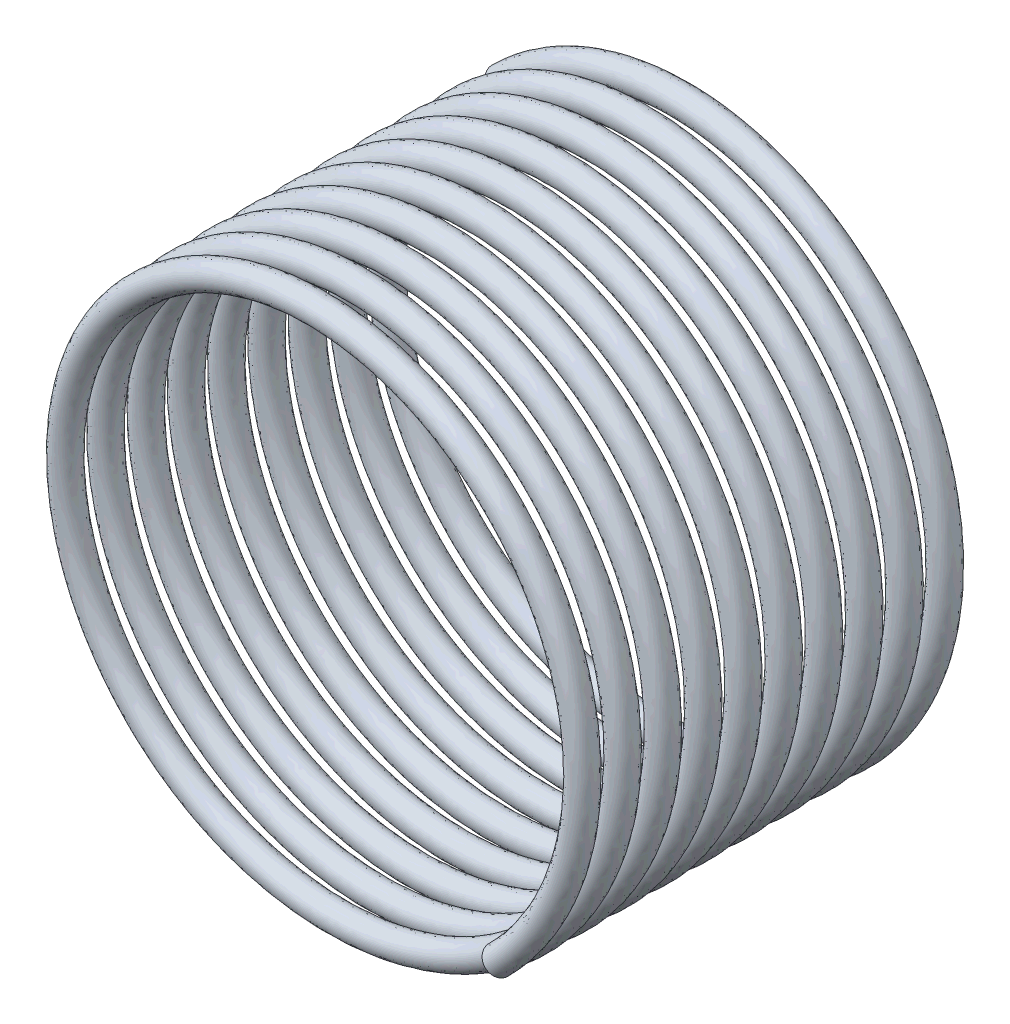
ISO-10303-21;
HEADER;
FILE_DESCRIPTION(('STEP AP214'),'2;1');
FILE_NAME('part.step','',(''),(''),'','','');
FILE_SCHEMA(('AUTOMOTIVE_DESIGN { 1 0 10303 214 1 1 1 1 }'));
ENDSEC;
DATA;
#1=APPLICATION_CONTEXT('core data for automotive mechanical design processes');
#2=APPLICATION_PROTOCOL_DEFINITION('international standard','automotive_design',2000,#1);
#3=PRODUCT_CONTEXT('',#1,'mechanical');
#4=PRODUCT('Part','Part','',(#3));
#5=PRODUCT_RELATED_PRODUCT_CATEGORY('part','',(#4));
#6=PRODUCT_DEFINITION_FORMATION('','',#4);
#7=PRODUCT_DEFINITION_CONTEXT('part definition',#1,'design');
#8=PRODUCT_DEFINITION('design','',#6,#7);
#9=PRODUCT_DEFINITION_SHAPE('','',#8);
#10=(LENGTH_UNIT() NAMED_UNIT(*) SI_UNIT(.MILLI.,.METRE.));
#11=(NAMED_UNIT(*) PLANE_ANGLE_UNIT() SI_UNIT($,.RADIAN.));
#12=(NAMED_UNIT(*) SI_UNIT($,.STERADIAN.) SOLID_ANGLE_UNIT());
#13=UNCERTAINTY_MEASURE_WITH_UNIT(LENGTH_MEASURE(1.E-05),#10,'distance_accuracy_value','');
#14=(GEOMETRIC_REPRESENTATION_CONTEXT(3) GLOBAL_UNCERTAINTY_ASSIGNED_CONTEXT((#13)) GLOBAL_UNIT_ASSIGNED_CONTEXT((#10,
#11,#12)) REPRESENTATION_CONTEXT('',''));
#15=CARTESIAN_POINT('',(0.,0.,0.));
#16=DIRECTION('',(0.,0.,1.));
#17=DIRECTION('',(1.,0.,0.));
#18=AXIS2_PLACEMENT_3D('',#15,#16,#17);
#19=CARTESIAN_POINT('',(-1.48492424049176,1.48492424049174,0.));
#20=DIRECTION('',(0.70710678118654,0.707106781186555,0.));
#21=DIRECTION('',(-0.707106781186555,0.70710678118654,0.));
#22=AXIS2_PLACEMENT_3D('',#19,#20,#21);
#23=PLANE('',#22);
#24=CARTESIAN_POINT('',(-1.34350288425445,1.34350288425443,0.));
#25=CARTESIAN_POINT('',(-1.34350288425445,1.34350288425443,-0.026158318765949));
#26=CARTESIAN_POINT('',(-1.35414286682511,1.35414286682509,-0.1));
#27=CARTESIAN_POINT('',(-1.4742842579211,1.47428425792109,-0.1));
#28=CARTESIAN_POINT('',(-1.48492424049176,1.48492424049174,-0.026158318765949));
#29=CARTESIAN_POINT('',(-1.48492424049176,1.48492424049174,0.0261583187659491));
#30=CARTESIAN_POINT('',(-1.4742842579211,1.47428425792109,0.1));
#31=CARTESIAN_POINT('',(-1.35414286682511,1.35414286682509,0.1));
#32=CARTESIAN_POINT('',(-1.34350288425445,1.34350288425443,0.026158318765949));
#33=CARTESIAN_POINT('',(-1.34350288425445,1.34350288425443,0.));
#34=(BOUNDED_CURVE() B_SPLINE_CURVE(3,(#24,#25,#26,#27,#28,#29,#30,#31,#32,#33),.UNSPECIFIED.,
.T.,.F.) B_SPLINE_CURVE_WITH_KNOTS((4,2,2,2,4),(0.,0.25,0.5,0.75,1.),
.UNSPECIFIED.) CURVE() GEOMETRIC_REPRESENTATION_ITEM() RATIONAL_B_SPLINE_CURVE((1.,1.,
0.68211091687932,0.68211091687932,1.,1.,0.68211091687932,0.68211091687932,1.,1.)) REPRESENTATION_ITEM(''));
#35=CARTESIAN_POINT('',(-1.34350288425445,1.34350288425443,0.));
#36=VERTEX_POINT('',#35);
#37=EDGE_CURVE('E33',#36,#36,#34,.F.);
#38=ORIENTED_EDGE('',*,*,#37,.T.);
#39=EDGE_LOOP('',(#38));
#40=FACE_BOUND('',#39,.T.);
#41=ADVANCED_FACE('F22',(#40),#23,.F.);
#42=CARTESIAN_POINT('',(1.48492424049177,-1.48492424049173,2.85));
#43=DIRECTION('',(-0.707106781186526,-0.707106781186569,0.));
#44=DIRECTION('',(0.707106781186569,-0.707106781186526,0.));
#45=AXIS2_PLACEMENT_3D('',#42,#43,#44);
#46=PLANE('',#45);
#47=CARTESIAN_POINT('',(1.34350288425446,-1.34350288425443,2.85));
#48=CARTESIAN_POINT('',(1.34350288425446,-1.34350288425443,2.87615831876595));
#49=CARTESIAN_POINT('',(1.35414286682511,-1.35414286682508,2.95));
#50=CARTESIAN_POINT('',(1.47428425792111,-1.47428425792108,2.95));
#51=CARTESIAN_POINT('',(1.48492424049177,-1.48492424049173,2.87615831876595));
#52=CARTESIAN_POINT('',(1.48492424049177,-1.48492424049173,2.82384168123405));
#53=CARTESIAN_POINT('',(1.47428425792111,-1.47428425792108,2.75));
#54=CARTESIAN_POINT('',(1.35414286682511,-1.35414286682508,2.75));
#55=CARTESIAN_POINT('',(1.34350288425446,-1.34350288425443,2.82384168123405));
#56=CARTESIAN_POINT('',(1.34350288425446,-1.34350288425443,2.85));
#57=(BOUNDED_CURVE() B_SPLINE_CURVE(3,(#47,#48,#49,#50,#51,#52,#53,#54,#55,#56),.UNSPECIFIED.,
.T.,.F.) B_SPLINE_CURVE_WITH_KNOTS((4,2,2,2,4),(0.,0.25,0.5,0.75,1.),
.UNSPECIFIED.) CURVE() GEOMETRIC_REPRESENTATION_ITEM() RATIONAL_B_SPLINE_CURVE((1.,1.,
0.68211091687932,0.68211091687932,1.,1.,0.68211091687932,0.68211091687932,1.,1.)) REPRESENTATION_ITEM(''));
#58=CARTESIAN_POINT('',(1.34350288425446,-1.34350288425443,2.85));
#59=VERTEX_POINT('',#58);
#60=EDGE_CURVE('E10',#59,#59,#57,.F.);
#61=ORIENTED_EDGE('',*,*,#60,.T.);
#62=EDGE_LOOP('',(#61));
#63=FACE_BOUND('',#62,.T.);
#64=ADVANCED_FACE('F24',(#63),#46,.T.);
#65=CARTESIAN_POINT('',(-1.34350288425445,1.34350288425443,0.));
#66=CARTESIAN_POINT('',(0.,2.68700576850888,0.0375));
#67=CARTESIAN_POINT('',(1.34350288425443,1.34350288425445,0.075));
#68=CARTESIAN_POINT('',(2.68700576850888,0.,0.1125));
#69=CARTESIAN_POINT('',(1.34350288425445,-1.34350288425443,0.15));
#70=CARTESIAN_POINT('',(0.,-2.68700576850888,0.1875));
#71=CARTESIAN_POINT('',(-1.34350288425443,-1.34350288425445,0.225));
#72=CARTESIAN_POINT('',(-2.68700576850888,0.,0.2625));
#73=CARTESIAN_POINT('',(-1.34350288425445,1.34350288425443,0.3));
#74=CARTESIAN_POINT('',(0.,2.68700576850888,0.3375));
#75=CARTESIAN_POINT('',(1.34350288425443,1.34350288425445,0.375));
#76=CARTESIAN_POINT('',(2.68700576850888,0.,0.4125));
#77=CARTESIAN_POINT('',(1.34350288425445,-1.34350288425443,0.45));
#78=CARTESIAN_POINT('',(0.,-2.68700576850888,0.4875));
#79=CARTESIAN_POINT('',(-1.34350288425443,-1.34350288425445,0.525));
#80=CARTESIAN_POINT('',(-2.68700576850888,0.,0.5625));
#81=CARTESIAN_POINT('',(-1.34350288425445,1.34350288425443,0.6));
#82=CARTESIAN_POINT('',(0.,2.68700576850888,0.6375));
#83=CARTESIAN_POINT('',(1.34350288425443,1.34350288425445,0.675));
#84=CARTESIAN_POINT('',(2.68700576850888,0.,0.7125));
#85=CARTESIAN_POINT('',(1.34350288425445,-1.34350288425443,0.75));
#86=CARTESIAN_POINT('',(0.,-2.68700576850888,0.7875));
#87=CARTESIAN_POINT('',(-1.34350288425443,-1.34350288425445,0.825));
#88=CARTESIAN_POINT('',(-2.68700576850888,0.,0.8625));
#89=CARTESIAN_POINT('',(-1.34350288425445,1.34350288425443,0.9));
#90=CARTESIAN_POINT('',(0.,2.68700576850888,0.9375));
#91=CARTESIAN_POINT('',(1.34350288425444,1.34350288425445,0.975));
#92=CARTESIAN_POINT('',(2.68700576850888,0.,1.0125));
#93=CARTESIAN_POINT('',(1.34350288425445,-1.34350288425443,1.05));
#94=CARTESIAN_POINT('',(0.,-2.68700576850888,1.0875));
#95=CARTESIAN_POINT('',(-1.34350288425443,-1.34350288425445,1.125));
#96=CARTESIAN_POINT('',(-2.68700576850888,0.,1.1625));
#97=CARTESIAN_POINT('',(-1.34350288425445,1.34350288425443,1.2));
#98=CARTESIAN_POINT('',(0.,2.68700576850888,1.2375));
#99=CARTESIAN_POINT('',(1.34350288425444,1.34350288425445,1.275));
#100=CARTESIAN_POINT('',(2.68700576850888,0.,1.3125));
#101=CARTESIAN_POINT('',(1.34350288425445,-1.34350288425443,1.35));
#102=CARTESIAN_POINT('',(0.,-2.68700576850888,1.3875));
#103=CARTESIAN_POINT('',(-1.34350288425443,-1.34350288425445,1.425));
#104=CARTESIAN_POINT('',(-2.68700576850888,0.,1.4625));
#105=CARTESIAN_POINT('',(-1.34350288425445,1.34350288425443,1.5));
#106=CARTESIAN_POINT('',(0.,2.68700576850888,1.5375));
#107=CARTESIAN_POINT('',(1.34350288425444,1.34350288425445,1.575));
#108=CARTESIAN_POINT('',(2.68700576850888,0.,1.6125));
#109=CARTESIAN_POINT('',(1.34350288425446,-1.34350288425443,1.65));
#110=CARTESIAN_POINT('',(0.,-2.68700576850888,1.6875));
#111=CARTESIAN_POINT('',(-1.34350288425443,-1.34350288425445,1.725));
#112=CARTESIAN_POINT('',(-2.68700576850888,0.,1.7625));
#113=CARTESIAN_POINT('',(-1.34350288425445,1.34350288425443,1.8));
#114=CARTESIAN_POINT('',(0.,2.68700576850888,1.8375));
#115=CARTESIAN_POINT('',(1.34350288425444,1.34350288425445,1.875));
#116=CARTESIAN_POINT('',(2.68700576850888,0.,1.9125));
#117=CARTESIAN_POINT('',(1.34350288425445,-1.34350288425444,1.95));
#118=CARTESIAN_POINT('',(0.,-2.68700576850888,1.9875));
#119=CARTESIAN_POINT('',(-1.34350288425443,-1.34350288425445,2.025));
#120=CARTESIAN_POINT('',(-2.68700576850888,0.,2.0625));
#121=CARTESIAN_POINT('',(-1.34350288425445,1.34350288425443,2.1));
#122=CARTESIAN_POINT('',(0.,2.68700576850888,2.1375));
#123=CARTESIAN_POINT('',(1.34350288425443,1.34350288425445,2.175));
#124=CARTESIAN_POINT('',(2.68700576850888,0.,2.2125));
#125=CARTESIAN_POINT('',(1.34350288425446,-1.34350288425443,2.25));
#126=CARTESIAN_POINT('',(0.,-2.68700576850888,2.2875));
#127=CARTESIAN_POINT('',(-1.34350288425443,-1.34350288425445,2.325));
#128=CARTESIAN_POINT('',(-2.68700576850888,0.,2.3625));
#129=CARTESIAN_POINT('',(-1.34350288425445,1.34350288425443,2.4));
#130=CARTESIAN_POINT('',(0.,2.68700576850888,2.4375));
#131=CARTESIAN_POINT('',(1.34350288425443,1.34350288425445,2.475));
#132=CARTESIAN_POINT('',(2.68700576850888,0.,2.5125));
#133=CARTESIAN_POINT('',(1.34350288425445,-1.34350288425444,2.55));
#134=CARTESIAN_POINT('',(0.,-2.68700576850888,2.5875));
#135=CARTESIAN_POINT('',(-1.34350288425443,-1.34350288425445,2.625));
#136=CARTESIAN_POINT('',(-2.68700576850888,0.,2.6625));
#137=CARTESIAN_POINT('',(-1.34350288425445,1.34350288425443,2.7));
#138=CARTESIAN_POINT('',(0.,2.68700576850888,2.7375));
#139=CARTESIAN_POINT('',(1.34350288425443,1.34350288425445,2.775));
#140=CARTESIAN_POINT('',(2.68700576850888,0.,2.8125));
#141=CARTESIAN_POINT('',(1.34350288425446,-1.34350288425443,2.85));
#142=CARTESIAN_POINT('',(-1.34350288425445,1.34350288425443,0.026158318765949));
#143=CARTESIAN_POINT('',(0.,2.68700576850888,0.063658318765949));
#144=CARTESIAN_POINT('',(1.34350288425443,1.34350288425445,0.101158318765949));
#145=CARTESIAN_POINT('',(2.68700576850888,0.,0.138658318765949));
#146=CARTESIAN_POINT('',(1.34350288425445,-1.34350288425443,0.176158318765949));
#147=CARTESIAN_POINT('',(0.,-2.68700576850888,0.213658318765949));
#148=CARTESIAN_POINT('',(-1.34350288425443,-1.34350288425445,0.251158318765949));
#149=CARTESIAN_POINT('',(-2.68700576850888,0.,0.288658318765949));
#150=CARTESIAN_POINT('',(-1.34350288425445,1.34350288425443,0.326158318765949));
#151=CARTESIAN_POINT('',(0.,2.68700576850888,0.363658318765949));
#152=CARTESIAN_POINT('',(1.34350288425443,1.34350288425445,0.401158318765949));
#153=CARTESIAN_POINT('',(2.68700576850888,0.,0.438658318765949));
#154=CARTESIAN_POINT('',(1.34350288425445,-1.34350288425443,0.476158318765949));
#155=CARTESIAN_POINT('',(0.,-2.68700576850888,0.513658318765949));
#156=CARTESIAN_POINT('',(-1.34350288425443,-1.34350288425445,0.551158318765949));
#157=CARTESIAN_POINT('',(-2.68700576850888,0.,0.588658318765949));
#158=CARTESIAN_POINT('',(-1.34350288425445,1.34350288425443,0.626158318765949));
#159=CARTESIAN_POINT('',(0.,2.68700576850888,0.663658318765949));
#160=CARTESIAN_POINT('',(1.34350288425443,1.34350288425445,0.701158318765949));
#161=CARTESIAN_POINT('',(2.68700576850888,0.,0.738658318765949));
#162=CARTESIAN_POINT('',(1.34350288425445,-1.34350288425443,0.776158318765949));
#163=CARTESIAN_POINT('',(0.,-2.68700576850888,0.813658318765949));
#164=CARTESIAN_POINT('',(-1.34350288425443,-1.34350288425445,0.851158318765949));
#165=CARTESIAN_POINT('',(-2.68700576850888,0.,0.888658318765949));
#166=CARTESIAN_POINT('',(-1.34350288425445,1.34350288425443,0.926158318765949));
#167=CARTESIAN_POINT('',(0.,2.68700576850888,0.963658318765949));
#168=CARTESIAN_POINT('',(1.34350288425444,1.34350288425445,1.00115831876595));
#169=CARTESIAN_POINT('',(2.68700576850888,0.,1.03865831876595));
#170=CARTESIAN_POINT('',(1.34350288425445,-1.34350288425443,1.07615831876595));
#171=CARTESIAN_POINT('',(0.,-2.68700576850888,1.11365831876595));
#172=CARTESIAN_POINT('',(-1.34350288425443,-1.34350288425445,1.15115831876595));
#173=CARTESIAN_POINT('',(-2.68700576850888,0.,1.18865831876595));
#174=CARTESIAN_POINT('',(-1.34350288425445,1.34350288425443,1.22615831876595));
#175=CARTESIAN_POINT('',(0.,2.68700576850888,1.26365831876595));
#176=CARTESIAN_POINT('',(1.34350288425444,1.34350288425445,1.30115831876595));
#177=CARTESIAN_POINT('',(2.68700576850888,0.,1.33865831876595));
#178=CARTESIAN_POINT('',(1.34350288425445,-1.34350288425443,1.37615831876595));
#179=CARTESIAN_POINT('',(0.,-2.68700576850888,1.41365831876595));
#180=CARTESIAN_POINT('',(-1.34350288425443,-1.34350288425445,1.45115831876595));
#181=CARTESIAN_POINT('',(-2.68700576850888,0.,1.48865831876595));
#182=CARTESIAN_POINT('',(-1.34350288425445,1.34350288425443,1.52615831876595));
#183=CARTESIAN_POINT('',(0.,2.68700576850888,1.56365831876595));
#184=CARTESIAN_POINT('',(1.34350288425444,1.34350288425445,1.60115831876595));
#185=CARTESIAN_POINT('',(2.68700576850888,0.,1.63865831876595));
#186=CARTESIAN_POINT('',(1.34350288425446,-1.34350288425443,1.67615831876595));
#187=CARTESIAN_POINT('',(0.,-2.68700576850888,1.71365831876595));
#188=CARTESIAN_POINT('',(-1.34350288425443,-1.34350288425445,1.75115831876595));
#189=CARTESIAN_POINT('',(-2.68700576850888,0.,1.78865831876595));
#190=CARTESIAN_POINT('',(-1.34350288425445,1.34350288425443,1.82615831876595));
#191=CARTESIAN_POINT('',(0.,2.68700576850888,1.86365831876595));
#192=CARTESIAN_POINT('',(1.34350288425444,1.34350288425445,1.90115831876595));
#193=CARTESIAN_POINT('',(2.68700576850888,0.,1.93865831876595));
#194=CARTESIAN_POINT('',(1.34350288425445,-1.34350288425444,1.97615831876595));
#195=CARTESIAN_POINT('',(0.,-2.68700576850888,2.01365831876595));
#196=CARTESIAN_POINT('',(-1.34350288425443,-1.34350288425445,2.05115831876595));
#197=CARTESIAN_POINT('',(-2.68700576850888,0.,2.08865831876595));
#198=CARTESIAN_POINT('',(-1.34350288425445,1.34350288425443,2.12615831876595));
#199=CARTESIAN_POINT('',(0.,2.68700576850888,2.16365831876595));
#200=CARTESIAN_POINT('',(1.34350288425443,1.34350288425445,2.20115831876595));
#201=CARTESIAN_POINT('',(2.68700576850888,0.,2.23865831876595));
#202=CARTESIAN_POINT('',(1.34350288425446,-1.34350288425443,2.27615831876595));
#203=CARTESIAN_POINT('',(0.,-2.68700576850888,2.31365831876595));
#204=CARTESIAN_POINT('',(-1.34350288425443,-1.34350288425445,2.35115831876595));
#205=CARTESIAN_POINT('',(-2.68700576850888,0.,2.38865831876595));
#206=CARTESIAN_POINT('',(-1.34350288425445,1.34350288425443,2.42615831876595));
#207=CARTESIAN_POINT('',(0.,2.68700576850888,2.46365831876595));
#208=CARTESIAN_POINT('',(1.34350288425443,1.34350288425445,2.50115831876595));
#209=CARTESIAN_POINT('',(2.68700576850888,0.,2.53865831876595));
#210=CARTESIAN_POINT('',(1.34350288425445,-1.34350288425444,2.57615831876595));
#211=CARTESIAN_POINT('',(0.,-2.68700576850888,2.61365831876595));
#212=CARTESIAN_POINT('',(-1.34350288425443,-1.34350288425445,2.65115831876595));
#213=CARTESIAN_POINT('',(-2.68700576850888,0.,2.68865831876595));
#214=CARTESIAN_POINT('',(-1.34350288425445,1.34350288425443,2.72615831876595));
#215=CARTESIAN_POINT('',(0.,2.68700576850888,2.76365831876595));
#216=CARTESIAN_POINT('',(1.34350288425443,1.34350288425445,2.80115831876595));
#217=CARTESIAN_POINT('',(2.68700576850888,0.,2.83865831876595));
#218=CARTESIAN_POINT('',(1.34350288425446,-1.34350288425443,2.87615831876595));
#219=CARTESIAN_POINT('',(-1.35414286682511,1.35414286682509,0.1));
#220=CARTESIAN_POINT('',(0.,2.7082857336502,0.1375));
#221=CARTESIAN_POINT('',(1.35414286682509,1.35414286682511,0.175));
#222=CARTESIAN_POINT('',(2.7082857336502,0.,0.2125));
#223=CARTESIAN_POINT('',(1.35414286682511,-1.35414286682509,0.25));
#224=CARTESIAN_POINT('',(0.,-2.7082857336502,0.2875));
#225=CARTESIAN_POINT('',(-1.35414286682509,-1.35414286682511,0.325));
#226=CARTESIAN_POINT('',(-2.7082857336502,0.,0.3625));
#227=CARTESIAN_POINT('',(-1.35414286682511,1.35414286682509,0.4));
#228=CARTESIAN_POINT('',(0.,2.7082857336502,0.4375));
#229=CARTESIAN_POINT('',(1.35414286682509,1.35414286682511,0.475));
#230=CARTESIAN_POINT('',(2.7082857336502,0.,0.5125));
#231=CARTESIAN_POINT('',(1.35414286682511,-1.35414286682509,0.55));
#232=CARTESIAN_POINT('',(0.,-2.7082857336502,0.5875));
#233=CARTESIAN_POINT('',(-1.35414286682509,-1.35414286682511,0.625));
#234=CARTESIAN_POINT('',(-2.7082857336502,0.,0.6625));
#235=CARTESIAN_POINT('',(-1.35414286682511,1.35414286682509,0.7));
#236=CARTESIAN_POINT('',(0.,2.7082857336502,0.7375));
#237=CARTESIAN_POINT('',(1.35414286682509,1.35414286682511,0.775));
#238=CARTESIAN_POINT('',(2.7082857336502,0.,0.8125));
#239=CARTESIAN_POINT('',(1.35414286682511,-1.35414286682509,0.85));
#240=CARTESIAN_POINT('',(0.,-2.7082857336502,0.8875));
#241=CARTESIAN_POINT('',(-1.35414286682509,-1.35414286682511,0.925));
#242=CARTESIAN_POINT('',(-2.7082857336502,0.,0.9625));
#243=CARTESIAN_POINT('',(-1.35414286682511,1.35414286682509,1.));
#244=CARTESIAN_POINT('',(0.,2.7082857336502,1.0375));
#245=CARTESIAN_POINT('',(1.35414286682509,1.3541428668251,1.075));
#246=CARTESIAN_POINT('',(2.7082857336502,0.,1.1125));
#247=CARTESIAN_POINT('',(1.35414286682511,-1.35414286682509,1.15));
#248=CARTESIAN_POINT('',(0.,-2.7082857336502,1.1875));
#249=CARTESIAN_POINT('',(-1.35414286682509,-1.35414286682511,1.225));
#250=CARTESIAN_POINT('',(-2.7082857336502,0.,1.2625));
#251=CARTESIAN_POINT('',(-1.35414286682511,1.35414286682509,1.3));
#252=CARTESIAN_POINT('',(0.,2.7082857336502,1.3375));
#253=CARTESIAN_POINT('',(1.35414286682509,1.3541428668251,1.375));
#254=CARTESIAN_POINT('',(2.7082857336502,0.,1.4125));
#255=CARTESIAN_POINT('',(1.35414286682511,-1.35414286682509,1.45));
#256=CARTESIAN_POINT('',(0.,-2.7082857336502,1.4875));
#257=CARTESIAN_POINT('',(-1.35414286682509,-1.35414286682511,1.525));
#258=CARTESIAN_POINT('',(-2.7082857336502,0.,1.5625));
#259=CARTESIAN_POINT('',(-1.35414286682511,1.35414286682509,1.6));
#260=CARTESIAN_POINT('',(0.,2.7082857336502,1.6375));
#261=CARTESIAN_POINT('',(1.35414286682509,1.35414286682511,1.675));
#262=CARTESIAN_POINT('',(2.7082857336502,0.,1.7125));
#263=CARTESIAN_POINT('',(1.35414286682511,-1.35414286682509,1.75));
#264=CARTESIAN_POINT('',(0.,-2.7082857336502,1.7875));
#265=CARTESIAN_POINT('',(-1.35414286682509,-1.35414286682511,1.825));
#266=CARTESIAN_POINT('',(-2.7082857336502,0.,1.8625));
#267=CARTESIAN_POINT('',(-1.35414286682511,1.35414286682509,1.9));
#268=CARTESIAN_POINT('',(0.,2.7082857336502,1.9375));
#269=CARTESIAN_POINT('',(1.35414286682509,1.35414286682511,1.975));
#270=CARTESIAN_POINT('',(2.7082857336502,0.,2.0125));
#271=CARTESIAN_POINT('',(1.3541428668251,-1.35414286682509,2.05));
#272=CARTESIAN_POINT('',(0.,-2.7082857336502,2.0875));
#273=CARTESIAN_POINT('',(-1.35414286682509,-1.35414286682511,2.125));
#274=CARTESIAN_POINT('',(-2.7082857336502,0.,2.1625));
#275=CARTESIAN_POINT('',(-1.35414286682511,1.35414286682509,2.2));
#276=CARTESIAN_POINT('',(0.,2.7082857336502,2.2375));
#277=CARTESIAN_POINT('',(1.35414286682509,1.35414286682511,2.275));
#278=CARTESIAN_POINT('',(2.7082857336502,0.,2.3125));
#279=CARTESIAN_POINT('',(1.35414286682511,-1.35414286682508,2.35));
#280=CARTESIAN_POINT('',(0.,-2.7082857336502,2.3875));
#281=CARTESIAN_POINT('',(-1.35414286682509,-1.35414286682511,2.425));
#282=CARTESIAN_POINT('',(-2.7082857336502,0.,2.4625));
#283=CARTESIAN_POINT('',(-1.35414286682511,1.35414286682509,2.5));
#284=CARTESIAN_POINT('',(0.,2.7082857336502,2.5375));
#285=CARTESIAN_POINT('',(1.35414286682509,1.35414286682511,2.575));
#286=CARTESIAN_POINT('',(2.7082857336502,0.,2.6125));
#287=CARTESIAN_POINT('',(1.3541428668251,-1.35414286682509,2.65));
#288=CARTESIAN_POINT('',(0.,-2.7082857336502,2.6875));
#289=CARTESIAN_POINT('',(-1.35414286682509,-1.35414286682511,2.725));
#290=CARTESIAN_POINT('',(-2.7082857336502,0.,2.7625));
#291=CARTESIAN_POINT('',(-1.35414286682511,1.35414286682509,2.8));
#292=CARTESIAN_POINT('',(0.,2.7082857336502,2.8375));
#293=CARTESIAN_POINT('',(1.35414286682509,1.35414286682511,2.875));
#294=CARTESIAN_POINT('',(2.7082857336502,0.,2.9125));
#295=CARTESIAN_POINT('',(1.35414286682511,-1.35414286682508,2.95));
#296=CARTESIAN_POINT('',(-1.4742842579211,1.47428425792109,0.1));
#297=CARTESIAN_POINT('',(0.,2.94856851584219,0.1375));
#298=CARTESIAN_POINT('',(1.47428425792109,1.4742842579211,0.175));
#299=CARTESIAN_POINT('',(2.94856851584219,0.,0.2125));
#300=CARTESIAN_POINT('',(1.4742842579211,-1.47428425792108,0.25));
#301=CARTESIAN_POINT('',(0.,-2.94856851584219,0.2875));
#302=CARTESIAN_POINT('',(-1.47428425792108,-1.4742842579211,0.325));
#303=CARTESIAN_POINT('',(-2.94856851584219,0.,0.3625));
#304=CARTESIAN_POINT('',(-1.4742842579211,1.47428425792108,0.4));
#305=CARTESIAN_POINT('',(0.,2.94856851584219,0.4375));
#306=CARTESIAN_POINT('',(1.47428425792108,1.4742842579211,0.475));
#307=CARTESIAN_POINT('',(2.94856851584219,0.,0.5125));
#308=CARTESIAN_POINT('',(1.4742842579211,-1.47428425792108,0.55));
#309=CARTESIAN_POINT('',(0.,-2.94856851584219,0.5875));
#310=CARTESIAN_POINT('',(-1.47428425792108,-1.4742842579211,0.625));
#311=CARTESIAN_POINT('',(-2.94856851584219,0.,0.6625));
#312=CARTESIAN_POINT('',(-1.4742842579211,1.47428425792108,0.7));
#313=CARTESIAN_POINT('',(0.,2.94856851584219,0.7375));
#314=CARTESIAN_POINT('',(1.47428425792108,1.4742842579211,0.775));
#315=CARTESIAN_POINT('',(2.94856851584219,0.,0.8125));
#316=CARTESIAN_POINT('',(1.4742842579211,-1.47428425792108,0.85));
#317=CARTESIAN_POINT('',(0.,-2.94856851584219,0.8875));
#318=CARTESIAN_POINT('',(-1.47428425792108,-1.4742842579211,0.925));
#319=CARTESIAN_POINT('',(-2.94856851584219,0.,0.9625));
#320=CARTESIAN_POINT('',(-1.4742842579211,1.47428425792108,1.));
#321=CARTESIAN_POINT('',(0.,2.94856851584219,1.0375));
#322=CARTESIAN_POINT('',(1.47428425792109,1.4742842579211,1.075));
#323=CARTESIAN_POINT('',(2.94856851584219,0.,1.1125));
#324=CARTESIAN_POINT('',(1.4742842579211,-1.47428425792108,1.15));
#325=CARTESIAN_POINT('',(0.,-2.94856851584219,1.1875));
#326=CARTESIAN_POINT('',(-1.47428425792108,-1.47428425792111,1.225));
#327=CARTESIAN_POINT('',(-2.94856851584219,0.,1.2625));
#328=CARTESIAN_POINT('',(-1.4742842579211,1.47428425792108,1.3));
#329=CARTESIAN_POINT('',(0.,2.94856851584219,1.3375));
#330=CARTESIAN_POINT('',(1.47428425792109,1.4742842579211,1.375));
#331=CARTESIAN_POINT('',(2.94856851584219,0.,1.4125));
#332=CARTESIAN_POINT('',(1.4742842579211,-1.47428425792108,1.45));
#333=CARTESIAN_POINT('',(0.,-2.94856851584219,1.4875));
#334=CARTESIAN_POINT('',(-1.47428425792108,-1.47428425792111,1.525));
#335=CARTESIAN_POINT('',(-2.94856851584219,0.,1.5625));
#336=CARTESIAN_POINT('',(-1.4742842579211,1.47428425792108,1.6));
#337=CARTESIAN_POINT('',(0.,2.94856851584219,1.6375));
#338=CARTESIAN_POINT('',(1.47428425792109,1.4742842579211,1.675));
#339=CARTESIAN_POINT('',(2.94856851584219,0.,1.7125));
#340=CARTESIAN_POINT('',(1.47428425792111,-1.47428425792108,1.75));
#341=CARTESIAN_POINT('',(0.,-2.94856851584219,1.7875));
#342=CARTESIAN_POINT('',(-1.47428425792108,-1.47428425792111,1.825));
#343=CARTESIAN_POINT('',(-2.94856851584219,0.,1.8625));
#344=CARTESIAN_POINT('',(-1.4742842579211,1.47428425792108,1.9));
#345=CARTESIAN_POINT('',(0.,2.94856851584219,1.9375));
#346=CARTESIAN_POINT('',(1.47428425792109,1.4742842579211,1.975));
#347=CARTESIAN_POINT('',(2.94856851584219,0.,2.0125));
#348=CARTESIAN_POINT('',(1.4742842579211,-1.47428425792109,2.05));
#349=CARTESIAN_POINT('',(0.,-2.94856851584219,2.0875));
#350=CARTESIAN_POINT('',(-1.47428425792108,-1.47428425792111,2.125));
#351=CARTESIAN_POINT('',(-2.94856851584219,0.,2.1625));
#352=CARTESIAN_POINT('',(-1.4742842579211,1.47428425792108,2.2));
#353=CARTESIAN_POINT('',(0.,2.94856851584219,2.2375));
#354=CARTESIAN_POINT('',(1.47428425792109,1.4742842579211,2.275));
#355=CARTESIAN_POINT('',(2.94856851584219,0.,2.3125));
#356=CARTESIAN_POINT('',(1.47428425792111,-1.47428425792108,2.35));
#357=CARTESIAN_POINT('',(0.,-2.94856851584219,2.3875));
#358=CARTESIAN_POINT('',(-1.47428425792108,-1.47428425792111,2.425));
#359=CARTESIAN_POINT('',(-2.94856851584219,0.,2.4625));
#360=CARTESIAN_POINT('',(-1.4742842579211,1.47428425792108,2.5));
#361=CARTESIAN_POINT('',(0.,2.94856851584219,2.5375));
#362=CARTESIAN_POINT('',(1.47428425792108,1.4742842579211,2.575));
#363=CARTESIAN_POINT('',(2.94856851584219,0.,2.6125));
#364=CARTESIAN_POINT('',(1.4742842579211,-1.47428425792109,2.65));
#365=CARTESIAN_POINT('',(0.,-2.94856851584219,2.6875));
#366=CARTESIAN_POINT('',(-1.47428425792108,-1.47428425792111,2.725));
#367=CARTESIAN_POINT('',(-2.94856851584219,0.,2.7625));
#368=CARTESIAN_POINT('',(-1.4742842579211,1.47428425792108,2.8));
#369=CARTESIAN_POINT('',(0.,2.94856851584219,2.8375));
#370=CARTESIAN_POINT('',(1.47428425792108,1.4742842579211,2.875));
#371=CARTESIAN_POINT('',(2.94856851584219,0.,2.9125));
#372=CARTESIAN_POINT('',(1.47428425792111,-1.47428425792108,2.95));
#373=CARTESIAN_POINT('',(-1.48492424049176,1.48492424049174,0.0261583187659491));
#374=CARTESIAN_POINT('',(0.,2.9698484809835,0.0636583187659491));
#375=CARTESIAN_POINT('',(1.48492424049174,1.48492424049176,0.101158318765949));
#376=CARTESIAN_POINT('',(2.9698484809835,0.,0.138658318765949));
#377=CARTESIAN_POINT('',(1.48492424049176,-1.48492424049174,0.176158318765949));
#378=CARTESIAN_POINT('',(0.,-2.9698484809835,0.213658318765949));
#379=CARTESIAN_POINT('',(-1.48492424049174,-1.48492424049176,0.251158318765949));
#380=CARTESIAN_POINT('',(-2.9698484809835,0.,0.288658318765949));
#381=CARTESIAN_POINT('',(-1.48492424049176,1.48492424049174,0.326158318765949));
#382=CARTESIAN_POINT('',(0.,2.9698484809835,0.363658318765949));
#383=CARTESIAN_POINT('',(1.48492424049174,1.48492424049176,0.401158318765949));
#384=CARTESIAN_POINT('',(2.9698484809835,0.,0.438658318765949));
#385=CARTESIAN_POINT('',(1.48492424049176,-1.48492424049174,0.476158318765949));
#386=CARTESIAN_POINT('',(0.,-2.9698484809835,0.513658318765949));
#387=CARTESIAN_POINT('',(-1.48492424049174,-1.48492424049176,0.551158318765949));
#388=CARTESIAN_POINT('',(-2.9698484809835,0.,0.588658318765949));
#389=CARTESIAN_POINT('',(-1.48492424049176,1.48492424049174,0.626158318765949));
#390=CARTESIAN_POINT('',(0.,2.9698484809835,0.663658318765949));
#391=CARTESIAN_POINT('',(1.48492424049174,1.48492424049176,0.701158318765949));
#392=CARTESIAN_POINT('',(2.9698484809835,0.,0.738658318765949));
#393=CARTESIAN_POINT('',(1.48492424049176,-1.48492424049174,0.776158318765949));
#394=CARTESIAN_POINT('',(0.,-2.9698484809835,0.813658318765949));
#395=CARTESIAN_POINT('',(-1.48492424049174,-1.48492424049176,0.851158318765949));
#396=CARTESIAN_POINT('',(-2.9698484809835,0.,0.888658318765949));
#397=CARTESIAN_POINT('',(-1.48492424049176,1.48492424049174,0.926158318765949));
#398=CARTESIAN_POINT('',(0.,2.9698484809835,0.963658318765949));
#399=CARTESIAN_POINT('',(1.48492424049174,1.48492424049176,1.00115831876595));
#400=CARTESIAN_POINT('',(2.9698484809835,0.,1.03865831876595));
#401=CARTESIAN_POINT('',(1.48492424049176,-1.48492424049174,1.07615831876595));
#402=CARTESIAN_POINT('',(0.,-2.9698484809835,1.11365831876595));
#403=CARTESIAN_POINT('',(-1.48492424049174,-1.48492424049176,1.15115831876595));
#404=CARTESIAN_POINT('',(-2.9698484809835,0.,1.18865831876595));
#405=CARTESIAN_POINT('',(-1.48492424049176,1.48492424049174,1.22615831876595));
#406=CARTESIAN_POINT('',(0.,2.9698484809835,1.26365831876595));
#407=CARTESIAN_POINT('',(1.48492424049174,1.48492424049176,1.30115831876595));
#408=CARTESIAN_POINT('',(2.9698484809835,0.,1.33865831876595));
#409=CARTESIAN_POINT('',(1.48492424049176,-1.48492424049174,1.37615831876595));
#410=CARTESIAN_POINT('',(0.,-2.9698484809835,1.41365831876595));
#411=CARTESIAN_POINT('',(-1.48492424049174,-1.48492424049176,1.45115831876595));
#412=CARTESIAN_POINT('',(-2.9698484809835,0.,1.48865831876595));
#413=CARTESIAN_POINT('',(-1.48492424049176,1.48492424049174,1.52615831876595));
#414=CARTESIAN_POINT('',(0.,2.9698484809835,1.56365831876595));
#415=CARTESIAN_POINT('',(1.48492424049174,1.48492424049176,1.60115831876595));
#416=CARTESIAN_POINT('',(2.9698484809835,0.,1.63865831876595));
#417=CARTESIAN_POINT('',(1.48492424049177,-1.48492424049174,1.67615831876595));
#418=CARTESIAN_POINT('',(0.,-2.9698484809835,1.71365831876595));
#419=CARTESIAN_POINT('',(-1.48492424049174,-1.48492424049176,1.75115831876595));
#420=CARTESIAN_POINT('',(-2.9698484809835,0.,1.78865831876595));
#421=CARTESIAN_POINT('',(-1.48492424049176,1.48492424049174,1.82615831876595));
#422=CARTESIAN_POINT('',(0.,2.9698484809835,1.86365831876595));
#423=CARTESIAN_POINT('',(1.48492424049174,1.48492424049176,1.90115831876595));
#424=CARTESIAN_POINT('',(2.9698484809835,0.,1.93865831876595));
#425=CARTESIAN_POINT('',(1.48492424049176,-1.48492424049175,1.97615831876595));
#426=CARTESIAN_POINT('',(0.,-2.9698484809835,2.01365831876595));
#427=CARTESIAN_POINT('',(-1.48492424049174,-1.48492424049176,2.05115831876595));
#428=CARTESIAN_POINT('',(-2.9698484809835,0.,2.08865831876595));
#429=CARTESIAN_POINT('',(-1.48492424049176,1.48492424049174,2.12615831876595));
#430=CARTESIAN_POINT('',(0.,2.9698484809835,2.16365831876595));
#431=CARTESIAN_POINT('',(1.48492424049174,1.48492424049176,2.20115831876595));
#432=CARTESIAN_POINT('',(2.9698484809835,0.,2.23865831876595));
#433=CARTESIAN_POINT('',(1.48492424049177,-1.48492424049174,2.27615831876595));
#434=CARTESIAN_POINT('',(0.,-2.9698484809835,2.31365831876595));
#435=CARTESIAN_POINT('',(-1.48492424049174,-1.48492424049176,2.35115831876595));
#436=CARTESIAN_POINT('',(-2.9698484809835,0.,2.38865831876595));
#437=CARTESIAN_POINT('',(-1.48492424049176,1.48492424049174,2.42615831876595));
#438=CARTESIAN_POINT('',(0.,2.9698484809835,2.46365831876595));
#439=CARTESIAN_POINT('',(1.48492424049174,1.48492424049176,2.50115831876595));
#440=CARTESIAN_POINT('',(2.9698484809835,0.,2.53865831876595));
#441=CARTESIAN_POINT('',(1.48492424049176,-1.48492424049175,2.57615831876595));
#442=CARTESIAN_POINT('',(0.,-2.9698484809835,2.61365831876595));
#443=CARTESIAN_POINT('',(-1.48492424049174,-1.48492424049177,2.65115831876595));
#444=CARTESIAN_POINT('',(-2.9698484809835,0.,2.68865831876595));
#445=CARTESIAN_POINT('',(-1.48492424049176,1.48492424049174,2.72615831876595));
#446=CARTESIAN_POINT('',(0.,2.9698484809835,2.76365831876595));
#447=CARTESIAN_POINT('',(1.48492424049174,1.48492424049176,2.80115831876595));
#448=CARTESIAN_POINT('',(2.9698484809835,0.,2.83865831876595));
#449=CARTESIAN_POINT('',(1.48492424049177,-1.48492424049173,2.87615831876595));
#450=CARTESIAN_POINT('',(-1.48492424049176,1.48492424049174,-0.026158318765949));
#451=CARTESIAN_POINT('',(0.,2.9698484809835,0.011341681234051));
#452=CARTESIAN_POINT('',(1.48492424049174,1.48492424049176,0.048841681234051));
#453=CARTESIAN_POINT('',(2.9698484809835,0.,0.086341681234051));
#454=CARTESIAN_POINT('',(1.48492424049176,-1.48492424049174,0.123841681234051));
#455=CARTESIAN_POINT('',(0.,-2.9698484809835,0.161341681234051));
#456=CARTESIAN_POINT('',(-1.48492424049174,-1.48492424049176,0.198841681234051));
#457=CARTESIAN_POINT('',(-2.9698484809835,0.,0.236341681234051));
#458=CARTESIAN_POINT('',(-1.48492424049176,1.48492424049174,0.273841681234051));
#459=CARTESIAN_POINT('',(0.,2.9698484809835,0.311341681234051));
#460=CARTESIAN_POINT('',(1.48492424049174,1.48492424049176,0.348841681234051));
#461=CARTESIAN_POINT('',(2.9698484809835,0.,0.386341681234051));
#462=CARTESIAN_POINT('',(1.48492424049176,-1.48492424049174,0.423841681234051));
#463=CARTESIAN_POINT('',(0.,-2.9698484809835,0.461341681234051));
#464=CARTESIAN_POINT('',(-1.48492424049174,-1.48492424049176,0.498841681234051));
#465=CARTESIAN_POINT('',(-2.9698484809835,0.,0.536341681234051));
#466=CARTESIAN_POINT('',(-1.48492424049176,1.48492424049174,0.573841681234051));
#467=CARTESIAN_POINT('',(0.,2.9698484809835,0.611341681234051));
#468=CARTESIAN_POINT('',(1.48492424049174,1.48492424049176,0.648841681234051));
#469=CARTESIAN_POINT('',(2.9698484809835,0.,0.686341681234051));
#470=CARTESIAN_POINT('',(1.48492424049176,-1.48492424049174,0.723841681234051));
#471=CARTESIAN_POINT('',(0.,-2.9698484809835,0.761341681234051));
#472=CARTESIAN_POINT('',(-1.48492424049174,-1.48492424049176,0.798841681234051));
#473=CARTESIAN_POINT('',(-2.9698484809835,0.,0.836341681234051));
#474=CARTESIAN_POINT('',(-1.48492424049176,1.48492424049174,0.873841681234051));
#475=CARTESIAN_POINT('',(0.,2.9698484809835,0.911341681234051));
#476=CARTESIAN_POINT('',(1.48492424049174,1.48492424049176,0.948841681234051));
#477=CARTESIAN_POINT('',(2.9698484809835,0.,0.986341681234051));
#478=CARTESIAN_POINT('',(1.48492424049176,-1.48492424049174,1.02384168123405));
#479=CARTESIAN_POINT('',(0.,-2.9698484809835,1.06134168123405));
#480=CARTESIAN_POINT('',(-1.48492424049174,-1.48492424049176,1.09884168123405));
#481=CARTESIAN_POINT('',(-2.9698484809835,0.,1.13634168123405));
#482=CARTESIAN_POINT('',(-1.48492424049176,1.48492424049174,1.17384168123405));
#483=CARTESIAN_POINT('',(0.,2.9698484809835,1.21134168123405));
#484=CARTESIAN_POINT('',(1.48492424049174,1.48492424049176,1.24884168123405));
#485=CARTESIAN_POINT('',(2.9698484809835,0.,1.28634168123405));
#486=CARTESIAN_POINT('',(1.48492424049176,-1.48492424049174,1.32384168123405));
#487=CARTESIAN_POINT('',(0.,-2.9698484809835,1.36134168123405));
#488=CARTESIAN_POINT('',(-1.48492424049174,-1.48492424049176,1.39884168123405));
#489=CARTESIAN_POINT('',(-2.9698484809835,0.,1.43634168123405));
#490=CARTESIAN_POINT('',(-1.48492424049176,1.48492424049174,1.47384168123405));
#491=CARTESIAN_POINT('',(0.,2.9698484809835,1.51134168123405));
#492=CARTESIAN_POINT('',(1.48492424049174,1.48492424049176,1.54884168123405));
#493=CARTESIAN_POINT('',(2.9698484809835,0.,1.58634168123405));
#494=CARTESIAN_POINT('',(1.48492424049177,-1.48492424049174,1.62384168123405));
#495=CARTESIAN_POINT('',(0.,-2.9698484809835,1.66134168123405));
#496=CARTESIAN_POINT('',(-1.48492424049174,-1.48492424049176,1.69884168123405));
#497=CARTESIAN_POINT('',(-2.9698484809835,0.,1.73634168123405));
#498=CARTESIAN_POINT('',(-1.48492424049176,1.48492424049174,1.77384168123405));
#499=CARTESIAN_POINT('',(0.,2.9698484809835,1.81134168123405));
#500=CARTESIAN_POINT('',(1.48492424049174,1.48492424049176,1.84884168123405));
#501=CARTESIAN_POINT('',(2.9698484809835,0.,1.88634168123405));
#502=CARTESIAN_POINT('',(1.48492424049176,-1.48492424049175,1.92384168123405));
#503=CARTESIAN_POINT('',(0.,-2.9698484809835,1.96134168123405));
#504=CARTESIAN_POINT('',(-1.48492424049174,-1.48492424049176,1.99884168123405));
#505=CARTESIAN_POINT('',(-2.9698484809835,0.,2.03634168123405));
#506=CARTESIAN_POINT('',(-1.48492424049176,1.48492424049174,2.07384168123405));
#507=CARTESIAN_POINT('',(0.,2.9698484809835,2.11134168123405));
#508=CARTESIAN_POINT('',(1.48492424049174,1.48492424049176,2.14884168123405));
#509=CARTESIAN_POINT('',(2.9698484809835,0.,2.18634168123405));
#510=CARTESIAN_POINT('',(1.48492424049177,-1.48492424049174,2.22384168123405));
#511=CARTESIAN_POINT('',(0.,-2.9698484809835,2.26134168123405));
#512=CARTESIAN_POINT('',(-1.48492424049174,-1.48492424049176,2.29884168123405));
#513=CARTESIAN_POINT('',(-2.9698484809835,0.,2.33634168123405));
#514=CARTESIAN_POINT('',(-1.48492424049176,1.48492424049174,2.37384168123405));
#515=CARTESIAN_POINT('',(0.,2.9698484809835,2.41134168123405));
#516=CARTESIAN_POINT('',(1.48492424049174,1.48492424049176,2.44884168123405));
#517=CARTESIAN_POINT('',(2.9698484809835,0.,2.48634168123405));
#518=CARTESIAN_POINT('',(1.48492424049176,-1.48492424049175,2.52384168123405));
#519=CARTESIAN_POINT('',(0.,-2.9698484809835,2.56134168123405));
#520=CARTESIAN_POINT('',(-1.48492424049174,-1.48492424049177,2.59884168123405));
#521=CARTESIAN_POINT('',(-2.9698484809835,0.,2.63634168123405));
#522=CARTESIAN_POINT('',(-1.48492424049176,1.48492424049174,2.67384168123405));
#523=CARTESIAN_POINT('',(0.,2.9698484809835,2.71134168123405));
#524=CARTESIAN_POINT('',(1.48492424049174,1.48492424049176,2.74884168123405));
#525=CARTESIAN_POINT('',(2.9698484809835,0.,2.78634168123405));
#526=CARTESIAN_POINT('',(1.48492424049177,-1.48492424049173,2.82384168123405));
#527=CARTESIAN_POINT('',(-1.4742842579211,1.47428425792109,-0.1));
#528=CARTESIAN_POINT('',(0.,2.94856851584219,-0.0625000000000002));
#529=CARTESIAN_POINT('',(1.47428425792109,1.4742842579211,-0.0250000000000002));
#530=CARTESIAN_POINT('',(2.94856851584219,0.,0.0124999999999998));
#531=CARTESIAN_POINT('',(1.4742842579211,-1.47428425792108,0.0499999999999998));
#532=CARTESIAN_POINT('',(0.,-2.94856851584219,0.0874999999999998));
#533=CARTESIAN_POINT('',(-1.47428425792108,-1.4742842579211,0.125));
#534=CARTESIAN_POINT('',(-2.94856851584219,0.,0.1625));
#535=CARTESIAN_POINT('',(-1.4742842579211,1.47428425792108,0.2));
#536=CARTESIAN_POINT('',(0.,2.94856851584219,0.2375));
#537=CARTESIAN_POINT('',(1.47428425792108,1.4742842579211,0.275));
#538=CARTESIAN_POINT('',(2.94856851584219,0.,0.3125));
#539=CARTESIAN_POINT('',(1.4742842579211,-1.47428425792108,0.35));
#540=CARTESIAN_POINT('',(0.,-2.94856851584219,0.3875));
#541=CARTESIAN_POINT('',(-1.47428425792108,-1.4742842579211,0.425));
#542=CARTESIAN_POINT('',(-2.94856851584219,0.,0.4625));
#543=CARTESIAN_POINT('',(-1.4742842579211,1.47428425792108,0.5));
#544=CARTESIAN_POINT('',(0.,2.94856851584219,0.5375));
#545=CARTESIAN_POINT('',(1.47428425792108,1.4742842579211,0.575));
#546=CARTESIAN_POINT('',(2.94856851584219,0.,0.6125));
#547=CARTESIAN_POINT('',(1.4742842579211,-1.47428425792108,0.65));
#548=CARTESIAN_POINT('',(0.,-2.94856851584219,0.6875));
#549=CARTESIAN_POINT('',(-1.47428425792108,-1.4742842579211,0.725));
#550=CARTESIAN_POINT('',(-2.94856851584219,0.,0.7625));
#551=CARTESIAN_POINT('',(-1.4742842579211,1.47428425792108,0.8));
#552=CARTESIAN_POINT('',(0.,2.94856851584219,0.8375));
#553=CARTESIAN_POINT('',(1.47428425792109,1.4742842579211,0.874999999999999));
#554=CARTESIAN_POINT('',(2.94856851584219,0.,0.9125));
#555=CARTESIAN_POINT('',(1.4742842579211,-1.47428425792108,0.95));
#556=CARTESIAN_POINT('',(0.,-2.94856851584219,0.9875));
#557=CARTESIAN_POINT('',(-1.47428425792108,-1.47428425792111,1.025));
#558=CARTESIAN_POINT('',(-2.94856851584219,0.,1.0625));
#559=CARTESIAN_POINT('',(-1.4742842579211,1.47428425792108,1.1));
#560=CARTESIAN_POINT('',(0.,2.94856851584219,1.1375));
#561=CARTESIAN_POINT('',(1.47428425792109,1.4742842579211,1.175));
#562=CARTESIAN_POINT('',(2.94856851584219,0.,1.2125));
#563=CARTESIAN_POINT('',(1.4742842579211,-1.47428425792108,1.25));
#564=CARTESIAN_POINT('',(0.,-2.94856851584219,1.2875));
#565=CARTESIAN_POINT('',(-1.47428425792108,-1.47428425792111,1.325));
#566=CARTESIAN_POINT('',(-2.94856851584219,0.,1.3625));
#567=CARTESIAN_POINT('',(-1.4742842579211,1.47428425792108,1.4));
#568=CARTESIAN_POINT('',(0.,2.94856851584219,1.4375));
#569=CARTESIAN_POINT('',(1.47428425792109,1.4742842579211,1.475));
#570=CARTESIAN_POINT('',(2.94856851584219,0.,1.5125));
#571=CARTESIAN_POINT('',(1.47428425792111,-1.47428425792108,1.55));
#572=CARTESIAN_POINT('',(0.,-2.94856851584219,1.5875));
#573=CARTESIAN_POINT('',(-1.47428425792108,-1.47428425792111,1.625));
#574=CARTESIAN_POINT('',(-2.94856851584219,0.,1.6625));
#575=CARTESIAN_POINT('',(-1.4742842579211,1.47428425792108,1.7));
#576=CARTESIAN_POINT('',(0.,2.94856851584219,1.7375));
#577=CARTESIAN_POINT('',(1.47428425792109,1.4742842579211,1.775));
#578=CARTESIAN_POINT('',(2.94856851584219,0.,1.8125));
#579=CARTESIAN_POINT('',(1.4742842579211,-1.47428425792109,1.85));
#580=CARTESIAN_POINT('',(0.,-2.94856851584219,1.8875));
#581=CARTESIAN_POINT('',(-1.47428425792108,-1.47428425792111,1.925));
#582=CARTESIAN_POINT('',(-2.94856851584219,0.,1.9625));
#583=CARTESIAN_POINT('',(-1.4742842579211,1.47428425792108,2.));
#584=CARTESIAN_POINT('',(0.,2.94856851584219,2.0375));
#585=CARTESIAN_POINT('',(1.47428425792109,1.4742842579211,2.075));
#586=CARTESIAN_POINT('',(2.94856851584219,0.,2.1125));
#587=CARTESIAN_POINT('',(1.47428425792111,-1.47428425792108,2.15));
#588=CARTESIAN_POINT('',(0.,-2.94856851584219,2.1875));
#589=CARTESIAN_POINT('',(-1.47428425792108,-1.47428425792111,2.225));
#590=CARTESIAN_POINT('',(-2.94856851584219,0.,2.2625));
#591=CARTESIAN_POINT('',(-1.4742842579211,1.47428425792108,2.3));
#592=CARTESIAN_POINT('',(0.,2.94856851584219,2.3375));
#593=CARTESIAN_POINT('',(1.47428425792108,1.4742842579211,2.375));
#594=CARTESIAN_POINT('',(2.94856851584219,0.,2.4125));
#595=CARTESIAN_POINT('',(1.4742842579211,-1.47428425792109,2.45));
#596=CARTESIAN_POINT('',(0.,-2.94856851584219,2.4875));
#597=CARTESIAN_POINT('',(-1.47428425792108,-1.47428425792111,2.525));
#598=CARTESIAN_POINT('',(-2.94856851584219,0.,2.5625));
#599=CARTESIAN_POINT('',(-1.4742842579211,1.47428425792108,2.6));
#600=CARTESIAN_POINT('',(0.,2.94856851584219,2.6375));
#601=CARTESIAN_POINT('',(1.47428425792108,1.4742842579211,2.675));
#602=CARTESIAN_POINT('',(2.94856851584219,0.,2.7125));
#603=CARTESIAN_POINT('',(1.47428425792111,-1.47428425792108,2.75));
#604=CARTESIAN_POINT('',(-1.35414286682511,1.35414286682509,-0.1));
#605=CARTESIAN_POINT('',(0.,2.7082857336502,-0.0625000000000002));
#606=CARTESIAN_POINT('',(1.35414286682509,1.35414286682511,-0.0250000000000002));
#607=CARTESIAN_POINT('',(2.7082857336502,0.,0.0124999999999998));
#608=CARTESIAN_POINT('',(1.35414286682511,-1.35414286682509,0.0499999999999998));
#609=CARTESIAN_POINT('',(0.,-2.7082857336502,0.0874999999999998));
#610=CARTESIAN_POINT('',(-1.35414286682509,-1.35414286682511,0.125));
#611=CARTESIAN_POINT('',(-2.7082857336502,0.,0.1625));
#612=CARTESIAN_POINT('',(-1.35414286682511,1.35414286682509,0.2));
#613=CARTESIAN_POINT('',(0.,2.7082857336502,0.2375));
#614=CARTESIAN_POINT('',(1.35414286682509,1.35414286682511,0.275));
#615=CARTESIAN_POINT('',(2.7082857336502,0.,0.3125));
#616=CARTESIAN_POINT('',(1.35414286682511,-1.35414286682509,0.35));
#617=CARTESIAN_POINT('',(0.,-2.7082857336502,0.3875));
#618=CARTESIAN_POINT('',(-1.35414286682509,-1.35414286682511,0.425));
#619=CARTESIAN_POINT('',(-2.7082857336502,0.,0.4625));
#620=CARTESIAN_POINT('',(-1.35414286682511,1.35414286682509,0.5));
#621=CARTESIAN_POINT('',(0.,2.7082857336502,0.5375));
#622=CARTESIAN_POINT('',(1.35414286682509,1.35414286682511,0.575));
#623=CARTESIAN_POINT('',(2.7082857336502,0.,0.6125));
#624=CARTESIAN_POINT('',(1.35414286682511,-1.35414286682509,0.65));
#625=CARTESIAN_POINT('',(0.,-2.7082857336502,0.6875));
#626=CARTESIAN_POINT('',(-1.35414286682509,-1.35414286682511,0.725));
#627=CARTESIAN_POINT('',(-2.7082857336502,0.,0.7625));
#628=CARTESIAN_POINT('',(-1.35414286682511,1.35414286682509,0.8));
#629=CARTESIAN_POINT('',(0.,2.7082857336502,0.8375));
#630=CARTESIAN_POINT('',(1.35414286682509,1.3541428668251,0.874999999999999));
#631=CARTESIAN_POINT('',(2.7082857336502,0.,0.9125));
#632=CARTESIAN_POINT('',(1.35414286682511,-1.35414286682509,0.95));
#633=CARTESIAN_POINT('',(0.,-2.7082857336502,0.9875));
#634=CARTESIAN_POINT('',(-1.35414286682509,-1.35414286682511,1.025));
#635=CARTESIAN_POINT('',(-2.7082857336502,0.,1.0625));
#636=CARTESIAN_POINT('',(-1.35414286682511,1.35414286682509,1.1));
#637=CARTESIAN_POINT('',(0.,2.7082857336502,1.1375));
#638=CARTESIAN_POINT('',(1.35414286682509,1.3541428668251,1.175));
#639=CARTESIAN_POINT('',(2.7082857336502,0.,1.2125));
#640=CARTESIAN_POINT('',(1.35414286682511,-1.35414286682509,1.25));
#641=CARTESIAN_POINT('',(0.,-2.7082857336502,1.2875));
#642=CARTESIAN_POINT('',(-1.35414286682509,-1.35414286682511,1.325));
#643=CARTESIAN_POINT('',(-2.7082857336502,0.,1.3625));
#644=CARTESIAN_POINT('',(-1.35414286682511,1.35414286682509,1.4));
#645=CARTESIAN_POINT('',(0.,2.7082857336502,1.4375));
#646=CARTESIAN_POINT('',(1.35414286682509,1.35414286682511,1.475));
#647=CARTESIAN_POINT('',(2.7082857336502,0.,1.5125));
#648=CARTESIAN_POINT('',(1.35414286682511,-1.35414286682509,1.55));
#649=CARTESIAN_POINT('',(0.,-2.7082857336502,1.5875));
#650=CARTESIAN_POINT('',(-1.35414286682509,-1.35414286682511,1.625));
#651=CARTESIAN_POINT('',(-2.7082857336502,0.,1.6625));
#652=CARTESIAN_POINT('',(-1.35414286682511,1.35414286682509,1.7));
#653=CARTESIAN_POINT('',(0.,2.7082857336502,1.7375));
#654=CARTESIAN_POINT('',(1.35414286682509,1.35414286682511,1.775));
#655=CARTESIAN_POINT('',(2.7082857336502,0.,1.8125));
#656=CARTESIAN_POINT('',(1.3541428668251,-1.35414286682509,1.85));
#657=CARTESIAN_POINT('',(0.,-2.7082857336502,1.8875));
#658=CARTESIAN_POINT('',(-1.35414286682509,-1.35414286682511,1.925));
#659=CARTESIAN_POINT('',(-2.7082857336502,0.,1.9625));
#660=CARTESIAN_POINT('',(-1.35414286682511,1.35414286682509,2.));
#661=CARTESIAN_POINT('',(0.,2.7082857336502,2.0375));
#662=CARTESIAN_POINT('',(1.35414286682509,1.35414286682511,2.075));
#663=CARTESIAN_POINT('',(2.7082857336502,0.,2.1125));
#664=CARTESIAN_POINT('',(1.35414286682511,-1.35414286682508,2.15));
#665=CARTESIAN_POINT('',(0.,-2.7082857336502,2.1875));
#666=CARTESIAN_POINT('',(-1.35414286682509,-1.35414286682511,2.225));
#667=CARTESIAN_POINT('',(-2.7082857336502,0.,2.2625));
#668=CARTESIAN_POINT('',(-1.35414286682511,1.35414286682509,2.3));
#669=CARTESIAN_POINT('',(0.,2.7082857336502,2.3375));
#670=CARTESIAN_POINT('',(1.35414286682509,1.35414286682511,2.375));
#671=CARTESIAN_POINT('',(2.7082857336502,0.,2.4125));
#672=CARTESIAN_POINT('',(1.3541428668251,-1.35414286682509,2.45));
#673=CARTESIAN_POINT('',(0.,-2.7082857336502,2.4875));
#674=CARTESIAN_POINT('',(-1.35414286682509,-1.35414286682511,2.525));
#675=CARTESIAN_POINT('',(-2.7082857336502,0.,2.5625));
#676=CARTESIAN_POINT('',(-1.35414286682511,1.35414286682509,2.6));
#677=CARTESIAN_POINT('',(0.,2.7082857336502,2.6375));
#678=CARTESIAN_POINT('',(1.35414286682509,1.35414286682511,2.675));
#679=CARTESIAN_POINT('',(2.7082857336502,0.,2.7125));
#680=CARTESIAN_POINT('',(1.35414286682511,-1.35414286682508,2.75));
#681=CARTESIAN_POINT('',(-1.34350288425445,1.34350288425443,-0.026158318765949));
#682=CARTESIAN_POINT('',(0.,2.68700576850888,0.011341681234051));
#683=CARTESIAN_POINT('',(1.34350288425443,1.34350288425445,0.048841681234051));
#684=CARTESIAN_POINT('',(2.68700576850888,0.,0.0863416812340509));
#685=CARTESIAN_POINT('',(1.34350288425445,-1.34350288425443,0.123841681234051));
#686=CARTESIAN_POINT('',(0.,-2.68700576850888,0.161341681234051));
#687=CARTESIAN_POINT('',(-1.34350288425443,-1.34350288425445,0.198841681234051));
#688=CARTESIAN_POINT('',(-2.68700576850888,0.,0.236341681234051));
#689=CARTESIAN_POINT('',(-1.34350288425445,1.34350288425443,0.273841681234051));
#690=CARTESIAN_POINT('',(0.,2.68700576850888,0.311341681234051));
#691=CARTESIAN_POINT('',(1.34350288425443,1.34350288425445,0.348841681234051));
#692=CARTESIAN_POINT('',(2.68700576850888,0.,0.386341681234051));
#693=CARTESIAN_POINT('',(1.34350288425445,-1.34350288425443,0.423841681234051));
#694=CARTESIAN_POINT('',(0.,-2.68700576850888,0.461341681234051));
#695=CARTESIAN_POINT('',(-1.34350288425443,-1.34350288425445,0.498841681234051));
#696=CARTESIAN_POINT('',(-2.68700576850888,0.,0.536341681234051));
#697=CARTESIAN_POINT('',(-1.34350288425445,1.34350288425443,0.573841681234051));
#698=CARTESIAN_POINT('',(0.,2.68700576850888,0.611341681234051));
#699=CARTESIAN_POINT('',(1.34350288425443,1.34350288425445,0.648841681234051));
#700=CARTESIAN_POINT('',(2.68700576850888,0.,0.686341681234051));
#701=CARTESIAN_POINT('',(1.34350288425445,-1.34350288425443,0.723841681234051));
#702=CARTESIAN_POINT('',(0.,-2.68700576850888,0.761341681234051));
#703=CARTESIAN_POINT('',(-1.34350288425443,-1.34350288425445,0.798841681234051));
#704=CARTESIAN_POINT('',(-2.68700576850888,0.,0.836341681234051));
#705=CARTESIAN_POINT('',(-1.34350288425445,1.34350288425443,0.873841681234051));
#706=CARTESIAN_POINT('',(0.,2.68700576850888,0.911341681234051));
#707=CARTESIAN_POINT('',(1.34350288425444,1.34350288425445,0.948841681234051));
#708=CARTESIAN_POINT('',(2.68700576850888,0.,0.986341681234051));
#709=CARTESIAN_POINT('',(1.34350288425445,-1.34350288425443,1.02384168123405));
#710=CARTESIAN_POINT('',(0.,-2.68700576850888,1.06134168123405));
#711=CARTESIAN_POINT('',(-1.34350288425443,-1.34350288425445,1.09884168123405));
#712=CARTESIAN_POINT('',(-2.68700576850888,0.,1.13634168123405));
#713=CARTESIAN_POINT('',(-1.34350288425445,1.34350288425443,1.17384168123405));
#714=CARTESIAN_POINT('',(0.,2.68700576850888,1.21134168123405));
#715=CARTESIAN_POINT('',(1.34350288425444,1.34350288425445,1.24884168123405));
#716=CARTESIAN_POINT('',(2.68700576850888,0.,1.28634168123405));
#717=CARTESIAN_POINT('',(1.34350288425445,-1.34350288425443,1.32384168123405));
#718=CARTESIAN_POINT('',(0.,-2.68700576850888,1.36134168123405));
#719=CARTESIAN_POINT('',(-1.34350288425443,-1.34350288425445,1.39884168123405));
#720=CARTESIAN_POINT('',(-2.68700576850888,0.,1.43634168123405));
#721=CARTESIAN_POINT('',(-1.34350288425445,1.34350288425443,1.47384168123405));
#722=CARTESIAN_POINT('',(0.,2.68700576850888,1.51134168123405));
#723=CARTESIAN_POINT('',(1.34350288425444,1.34350288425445,1.54884168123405));
#724=CARTESIAN_POINT('',(2.68700576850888,0.,1.58634168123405));
#725=CARTESIAN_POINT('',(1.34350288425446,-1.34350288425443,1.62384168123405));
#726=CARTESIAN_POINT('',(0.,-2.68700576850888,1.66134168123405));
#727=CARTESIAN_POINT('',(-1.34350288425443,-1.34350288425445,1.69884168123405));
#728=CARTESIAN_POINT('',(-2.68700576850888,0.,1.73634168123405));
#729=CARTESIAN_POINT('',(-1.34350288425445,1.34350288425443,1.77384168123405));
#730=CARTESIAN_POINT('',(0.,2.68700576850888,1.81134168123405));
#731=CARTESIAN_POINT('',(1.34350288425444,1.34350288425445,1.84884168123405));
#732=CARTESIAN_POINT('',(2.68700576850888,0.,1.88634168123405));
#733=CARTESIAN_POINT('',(1.34350288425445,-1.34350288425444,1.92384168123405));
#734=CARTESIAN_POINT('',(0.,-2.68700576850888,1.96134168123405));
#735=CARTESIAN_POINT('',(-1.34350288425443,-1.34350288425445,1.99884168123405));
#736=CARTESIAN_POINT('',(-2.68700576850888,0.,2.03634168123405));
#737=CARTESIAN_POINT('',(-1.34350288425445,1.34350288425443,2.07384168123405));
#738=CARTESIAN_POINT('',(0.,2.68700576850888,2.11134168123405));
#739=CARTESIAN_POINT('',(1.34350288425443,1.34350288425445,2.14884168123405));
#740=CARTESIAN_POINT('',(2.68700576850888,0.,2.18634168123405));
#741=CARTESIAN_POINT('',(1.34350288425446,-1.34350288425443,2.22384168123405));
#742=CARTESIAN_POINT('',(0.,-2.68700576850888,2.26134168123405));
#743=CARTESIAN_POINT('',(-1.34350288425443,-1.34350288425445,2.29884168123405));
#744=CARTESIAN_POINT('',(-2.68700576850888,0.,2.33634168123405));
#745=CARTESIAN_POINT('',(-1.34350288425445,1.34350288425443,2.37384168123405));
#746=CARTESIAN_POINT('',(0.,2.68700576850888,2.41134168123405));
#747=CARTESIAN_POINT('',(1.34350288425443,1.34350288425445,2.44884168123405));
#748=CARTESIAN_POINT('',(2.68700576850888,0.,2.48634168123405));
#749=CARTESIAN_POINT('',(1.34350288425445,-1.34350288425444,2.52384168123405));
#750=CARTESIAN_POINT('',(0.,-2.68700576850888,2.56134168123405));
#751=CARTESIAN_POINT('',(-1.34350288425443,-1.34350288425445,2.59884168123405));
#752=CARTESIAN_POINT('',(-2.68700576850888,0.,2.63634168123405));
#753=CARTESIAN_POINT('',(-1.34350288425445,1.34350288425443,2.67384168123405));
#754=CARTESIAN_POINT('',(0.,2.68700576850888,2.71134168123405));
#755=CARTESIAN_POINT('',(1.34350288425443,1.34350288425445,2.74884168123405));
#756=CARTESIAN_POINT('',(2.68700576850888,0.,2.78634168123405));
#757=CARTESIAN_POINT('',(1.34350288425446,-1.34350288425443,2.82384168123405));
#758=CARTESIAN_POINT('',(-1.34350288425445,1.34350288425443,0.));
#759=CARTESIAN_POINT('',(0.,2.68700576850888,0.0375));
#760=CARTESIAN_POINT('',(1.34350288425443,1.34350288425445,0.075));
#761=CARTESIAN_POINT('',(2.68700576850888,0.,0.1125));
#762=CARTESIAN_POINT('',(1.34350288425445,-1.34350288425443,0.15));
#763=CARTESIAN_POINT('',(0.,-2.68700576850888,0.1875));
#764=CARTESIAN_POINT('',(-1.34350288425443,-1.34350288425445,0.225));
#765=CARTESIAN_POINT('',(-2.68700576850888,0.,0.2625));
#766=CARTESIAN_POINT('',(-1.34350288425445,1.34350288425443,0.3));
#767=CARTESIAN_POINT('',(0.,2.68700576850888,0.3375));
#768=CARTESIAN_POINT('',(1.34350288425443,1.34350288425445,0.375));
#769=CARTESIAN_POINT('',(2.68700576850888,0.,0.4125));
#770=CARTESIAN_POINT('',(1.34350288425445,-1.34350288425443,0.45));
#771=CARTESIAN_POINT('',(0.,-2.68700576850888,0.4875));
#772=CARTESIAN_POINT('',(-1.34350288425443,-1.34350288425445,0.525));
#773=CARTESIAN_POINT('',(-2.68700576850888,0.,0.5625));
#774=CARTESIAN_POINT('',(-1.34350288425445,1.34350288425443,0.6));
#775=CARTESIAN_POINT('',(0.,2.68700576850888,0.6375));
#776=CARTESIAN_POINT('',(1.34350288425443,1.34350288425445,0.675));
#777=CARTESIAN_POINT('',(2.68700576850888,0.,0.7125));
#778=CARTESIAN_POINT('',(1.34350288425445,-1.34350288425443,0.75));
#779=CARTESIAN_POINT('',(0.,-2.68700576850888,0.7875));
#780=CARTESIAN_POINT('',(-1.34350288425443,-1.34350288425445,0.825));
#781=CARTESIAN_POINT('',(-2.68700576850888,0.,0.8625));
#782=CARTESIAN_POINT('',(-1.34350288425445,1.34350288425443,0.9));
#783=CARTESIAN_POINT('',(0.,2.68700576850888,0.9375));
#784=CARTESIAN_POINT('',(1.34350288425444,1.34350288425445,0.975));
#785=CARTESIAN_POINT('',(2.68700576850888,0.,1.0125));
#786=CARTESIAN_POINT('',(1.34350288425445,-1.34350288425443,1.05));
#787=CARTESIAN_POINT('',(0.,-2.68700576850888,1.0875));
#788=CARTESIAN_POINT('',(-1.34350288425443,-1.34350288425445,1.125));
#789=CARTESIAN_POINT('',(-2.68700576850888,0.,1.1625));
#790=CARTESIAN_POINT('',(-1.34350288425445,1.34350288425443,1.2));
#791=CARTESIAN_POINT('',(0.,2.68700576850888,1.2375));
#792=CARTESIAN_POINT('',(1.34350288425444,1.34350288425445,1.275));
#793=CARTESIAN_POINT('',(2.68700576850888,0.,1.3125));
#794=CARTESIAN_POINT('',(1.34350288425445,-1.34350288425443,1.35));
#795=CARTESIAN_POINT('',(0.,-2.68700576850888,1.3875));
#796=CARTESIAN_POINT('',(-1.34350288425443,-1.34350288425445,1.425));
#797=CARTESIAN_POINT('',(-2.68700576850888,0.,1.4625));
#798=CARTESIAN_POINT('',(-1.34350288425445,1.34350288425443,1.5));
#799=CARTESIAN_POINT('',(0.,2.68700576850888,1.5375));
#800=CARTESIAN_POINT('',(1.34350288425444,1.34350288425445,1.575));
#801=CARTESIAN_POINT('',(2.68700576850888,0.,1.6125));
#802=CARTESIAN_POINT('',(1.34350288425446,-1.34350288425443,1.65));
#803=CARTESIAN_POINT('',(0.,-2.68700576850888,1.6875));
#804=CARTESIAN_POINT('',(-1.34350288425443,-1.34350288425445,1.725));
#805=CARTESIAN_POINT('',(-2.68700576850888,0.,1.7625));
#806=CARTESIAN_POINT('',(-1.34350288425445,1.34350288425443,1.8));
#807=CARTESIAN_POINT('',(0.,2.68700576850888,1.8375));
#808=CARTESIAN_POINT('',(1.34350288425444,1.34350288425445,1.875));
#809=CARTESIAN_POINT('',(2.68700576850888,0.,1.9125));
#810=CARTESIAN_POINT('',(1.34350288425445,-1.34350288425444,1.95));
#811=CARTESIAN_POINT('',(0.,-2.68700576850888,1.9875));
#812=CARTESIAN_POINT('',(-1.34350288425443,-1.34350288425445,2.025));
#813=CARTESIAN_POINT('',(-2.68700576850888,0.,2.0625));
#814=CARTESIAN_POINT('',(-1.34350288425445,1.34350288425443,2.1));
#815=CARTESIAN_POINT('',(0.,2.68700576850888,2.1375));
#816=CARTESIAN_POINT('',(1.34350288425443,1.34350288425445,2.175));
#817=CARTESIAN_POINT('',(2.68700576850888,0.,2.2125));
#818=CARTESIAN_POINT('',(1.34350288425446,-1.34350288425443,2.25));
#819=CARTESIAN_POINT('',(0.,-2.68700576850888,2.2875));
#820=CARTESIAN_POINT('',(-1.34350288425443,-1.34350288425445,2.325));
#821=CARTESIAN_POINT('',(-2.68700576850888,0.,2.3625));
#822=CARTESIAN_POINT('',(-1.34350288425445,1.34350288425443,2.4));
#823=CARTESIAN_POINT('',(0.,2.68700576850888,2.4375));
#824=CARTESIAN_POINT('',(1.34350288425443,1.34350288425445,2.475));
#825=CARTESIAN_POINT('',(2.68700576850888,0.,2.5125));
#826=CARTESIAN_POINT('',(1.34350288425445,-1.34350288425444,2.55));
#827=CARTESIAN_POINT('',(0.,-2.68700576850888,2.5875));
#828=CARTESIAN_POINT('',(-1.34350288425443,-1.34350288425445,2.625));
#829=CARTESIAN_POINT('',(-2.68700576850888,0.,2.6625));
#830=CARTESIAN_POINT('',(-1.34350288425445,1.34350288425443,2.7));
#831=CARTESIAN_POINT('',(0.,2.68700576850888,2.7375));
#832=CARTESIAN_POINT('',(1.34350288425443,1.34350288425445,2.775));
#833=CARTESIAN_POINT('',(2.68700576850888,0.,2.8125));
#834=CARTESIAN_POINT('',(1.34350288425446,-1.34350288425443,2.85));
#835=(BOUNDED_SURFACE() B_SPLINE_SURFACE(3,2,((#65,#66,#67,#68,#69,#70,#71,#72,#73,#74,#75,#76,
#77,#78,#79,#80,#81,#82,#83,#84,#85,#86,#87,#88,#89,#90,#91,#92,#93,#94,#95,#96,#97,#98,#99,
#100,#101,#102,#103,#104,#105,#106,#107,#108,#109,#110,#111,#112,#113,#114,#115,#116,#117,#118,
#119,#120,#121,#122,#123,#124,#125,#126,#127,#128,#129,#130,#131,#132,#133,#134,#135,#136,#137,
#138,#139,#140,#141),(#142,#143,#144,#145,#146,#147,#148,#149,#150,#151,#152,#153,#154,#155,
#156,#157,#158,#159,#160,#161,#162,#163,#164,#165,#166,#167,#168,#169,#170,#171,#172,#173,#174,
#175,#176,#177,#178,#179,#180,#181,#182,#183,#184,#185,#186,#187,#188,#189,#190,#191,#192,#193,
#194,#195,#196,#197,#198,#199,#200,#201,#202,#203,#204,#205,#206,#207,#208,#209,#210,#211,#212,
#213,#214,#215,#216,#217,#218),(#219,#220,#221,#222,#223,#224,#225,#226,#227,#228,#229,#230,
#231,#232,#233,#234,#235,#236,#237,#238,#239,#240,#241,#242,#243,#244,#245,#246,#247,#248,#249,
#250,#251,#252,#253,#254,#255,#256,#257,#258,#259,#260,#261,#262,#263,#264,#265,#266,#267,#268,
#269,#270,#271,#272,#273,#274,#275,#276,#277,#278,#279,#280,#281,#282,#283,#284,#285,#286,#287,
#288,#289,#290,#291,#292,#293,#294,#295),(#296,#297,#298,#299,#300,#301,#302,#303,#304,#305,
#306,#307,#308,#309,#310,#311,#312,#313,#314,#315,#316,#317,#318,#319,#320,#321,#322,#323,#324,
#325,#326,#327,#328,#329,#330,#331,#332,#333,#334,#335,#336,#337,#338,#339,#340,#341,#342,#343,
#344,#345,#346,#347,#348,#349,#350,#351,#352,#353,#354,#355,#356,#357,#358,#359,#360,#361,#362,
#363,#364,#365,#366,#367,#368,#369,#370,#371,#372),(#373,#374,#375,#376,#377,#378,#379,#380,
#381,#382,#383,#384,#385,#386,#387,#388,#389,#390,#391,#392,#393,#394,#395,#396,#397,#398,#399,
#400,#401,#402,#403,#404,#405,#406,#407,#408,#409,#410,#411,#412,#413,#414,#415,#416,#417,#418,
#419,#420,#421,#422,#423,#424,#425,#426,#427,#428,#429,#430,#431,#432,#433,#434,#435,#436,#437,
#438,#439,#440,#441,#442,#443,#444,#445,#446,#447,#448,#449),(#450,#451,#452,#453,#454,#455,
#456,#457,#458,#459,#460,#461,#462,#463,#464,#465,#466,#467,#468,#469,#470,#471,#472,#473,#474,
#475,#476,#477,#478,#479,#480,#481,#482,#483,#484,#485,#486,#487,#488,#489,#490,#491,#492,#493,
#494,#495,#496,#497,#498,#499,#500,#501,#502,#503,#504,#505,#506,#507,#508,#509,#510,#511,#512,
#513,#514,#515,#516,#517,#518,#519,#520,#521,#522,#523,#524,#525,#526),(#527,#528,#529,#530,
#531,#532,#533,#534,#535,#536,#537,#538,#539,#540,#541,#542,#543,#544,#545,#546,#547,#548,#549,
#550,#551,#552,#553,#554,#555,#556,#557,#558,#559,#560,#561,#562,#563,#564,#565,#566,#567,#568,
#569,#570,#571,#572,#573,#574,#575,#576,#577,#578,#579,#580,#581,#582,#583,#584,#585,#586,#587,
#588,#589,#590,#591,#592,#593,#594,#595,#596,#597,#598,#599,#600,#601,#602,#603),(#604,#605,
#606,#607,#608,#609,#610,#611,#612,#613,#614,#615,#616,#617,#618,#619,#620,#621,#622,#623,#624,
#625,#626,#627,#628,#629,#630,#631,#632,#633,#634,#635,#636,#637,#638,#639,#640,#641,#642,#643,
#644,#645,#646,#647,#648,#649,#650,#651,#652,#653,#654,#655,#656,#657,#658,#659,#660,#661,#662,
#663,#664,#665,#666,#667,#668,#669,#670,#671,#672,#673,#674,#675,#676,#677,#678,#679,#680),
(#681,#682,#683,#684,#685,#686,#687,#688,#689,#690,#691,#692,#693,#694,#695,#696,#697,#698,#699,
#700,#701,#702,#703,#704,#705,#706,#707,#708,#709,#710,#711,#712,#713,#714,#715,#716,#717,#718,
#719,#720,#721,#722,#723,#724,#725,#726,#727,#728,#729,#730,#731,#732,#733,#734,#735,#736,#737,
#738,#739,#740,#741,#742,#743,#744,#745,#746,#747,#748,#749,#750,#751,#752,#753,#754,#755,#756,
#757),(#758,#759,#760,#761,#762,#763,#764,#765,#766,#767,#768,#769,#770,#771,#772,#773,#774,
#775,#776,#777,#778,#779,#780,#781,#782,#783,#784,#785,#786,#787,#788,#789,#790,#791,#792,#793,
#794,#795,#796,#797,#798,#799,#800,#801,#802,#803,#804,#805,#806,#807,#808,#809,#810,#811,#812,
#813,#814,#815,#816,#817,#818,#819,#820,#821,#822,#823,#824,#825,#826,#827,#828,#829,#830,#831,
#832,#833,#834)),.UNSPECIFIED.,.T.,.F.,.F.) B_SPLINE_SURFACE_WITH_KNOTS((4,2,2,2,4),(3,2,2,2,2,
2,2,2,2,2,2,2,2,2,2,2,2,2,2,2,2,2,2,2,2,2,2,2,2,2,2,2,2,2,2,2,2,2,3),(0.,0.25,0.5,0.75,1.),(0.,
0.025,0.05,0.075,0.1,0.125,0.15,0.175,0.2,0.225,0.25,0.275,0.3,0.325,0.35,0.375,0.4,0.425,0.45,
0.475,0.5,0.525,0.55,0.575,0.6,0.625,0.65,0.675,0.7,0.725,0.75,0.775,0.8,0.825,0.85,0.875,0.9,
0.925,0.95),.UNSPECIFIED.) GEOMETRIC_REPRESENTATION_ITEM() RATIONAL_B_SPLINE_SURFACE(((1.,
0.707106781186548,1.,0.707106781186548,1.,0.707106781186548,1.,0.707106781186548,1.,
0.707106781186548,1.,0.707106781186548,1.,0.707106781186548,1.,0.707106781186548,1.,
0.707106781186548,1.,0.707106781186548,1.,0.707106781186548,1.,0.707106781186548,1.,
0.707106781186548,1.,0.707106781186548,1.,0.707106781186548,1.,0.707106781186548,1.,
0.707106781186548,1.,0.707106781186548,1.,0.707106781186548,1.,0.707106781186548,1.,
0.707106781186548,1.,0.707106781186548,1.,0.707106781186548,1.,0.707106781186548,1.,
0.707106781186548,1.,0.707106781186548,1.,0.707106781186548,1.,0.707106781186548,1.,
0.707106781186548,1.,0.707106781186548,1.,0.707106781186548,1.,0.707106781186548,1.,
0.707106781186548,1.,0.707106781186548,1.,0.707106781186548,1.,0.707106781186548,1.,
0.707106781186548,1.,0.707106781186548,1.),(1.,0.707106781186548,1.,0.707106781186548,1.,
0.707106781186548,1.,0.707106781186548,1.,0.707106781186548,1.,0.707106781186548,1.,
0.707106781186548,1.,0.707106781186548,1.,0.707106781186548,1.,0.707106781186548,1.,
0.707106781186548,1.,0.707106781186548,1.,0.707106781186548,1.,0.707106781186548,1.,
0.707106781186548,1.,0.707106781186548,1.,0.707106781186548,1.,0.707106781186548,1.,
0.707106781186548,1.,0.707106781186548,1.,0.707106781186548,1.,0.707106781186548,1.,
0.707106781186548,1.,0.707106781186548,1.,0.707106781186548,1.,0.707106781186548,1.,
0.707106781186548,1.,0.707106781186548,1.,0.707106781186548,1.,0.707106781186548,1.,
0.707106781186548,1.,0.707106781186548,1.,0.707106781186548,1.,0.707106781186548,1.,
0.707106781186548,1.,0.707106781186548,1.,0.707106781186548,1.,0.707106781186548,1.),
(0.68211091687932,0.482325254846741,0.68211091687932,0.482325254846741,0.68211091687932,
0.482325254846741,0.68211091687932,0.482325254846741,0.68211091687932,0.482325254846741,
0.68211091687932,0.482325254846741,0.68211091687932,0.482325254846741,0.68211091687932,
0.482325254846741,0.68211091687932,0.482325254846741,0.68211091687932,0.482325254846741,
0.68211091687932,0.482325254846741,0.68211091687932,0.482325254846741,0.68211091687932,
0.482325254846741,0.68211091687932,0.482325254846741,0.68211091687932,0.482325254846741,
0.68211091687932,0.482325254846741,0.68211091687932,0.482325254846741,0.68211091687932,
0.482325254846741,0.68211091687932,0.482325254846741,0.68211091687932,0.482325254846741,
0.68211091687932,0.482325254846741,0.68211091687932,0.482325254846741,0.68211091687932,
0.482325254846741,0.68211091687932,0.482325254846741,0.68211091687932,0.482325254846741,
0.68211091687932,0.482325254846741,0.68211091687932,0.482325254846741,0.68211091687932,
0.482325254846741,0.68211091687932,0.482325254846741,0.68211091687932,0.482325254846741,
0.68211091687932,0.482325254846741,0.68211091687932,0.482325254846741,0.68211091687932,
0.482325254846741,0.68211091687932,0.482325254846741,0.68211091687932,0.482325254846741,
0.68211091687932,0.482325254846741,0.68211091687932,0.482325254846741,0.68211091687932,
0.482325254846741,0.68211091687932),(0.68211091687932,0.482325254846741,0.68211091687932,
0.482325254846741,0.68211091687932,0.482325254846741,0.68211091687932,0.482325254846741,
0.68211091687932,0.482325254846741,0.68211091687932,0.482325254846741,0.68211091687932,
0.482325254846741,0.68211091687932,0.482325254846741,0.68211091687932,0.482325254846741,
0.68211091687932,0.482325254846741,0.68211091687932,0.482325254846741,0.68211091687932,
0.482325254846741,0.68211091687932,0.482325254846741,0.68211091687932,0.482325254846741,
0.68211091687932,0.482325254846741,0.68211091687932,0.482325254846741,0.68211091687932,
0.482325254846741,0.68211091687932,0.482325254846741,0.68211091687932,0.482325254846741,
0.68211091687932,0.482325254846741,0.68211091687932,0.482325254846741,0.68211091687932,
0.482325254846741,0.68211091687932,0.482325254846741,0.68211091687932,0.482325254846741,
0.68211091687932,0.482325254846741,0.68211091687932,0.482325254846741,0.68211091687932,
0.482325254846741,0.68211091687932,0.482325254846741,0.68211091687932,0.482325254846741,
0.68211091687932,0.482325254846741,0.68211091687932,0.482325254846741,0.68211091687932,
0.482325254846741,0.68211091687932,0.482325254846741,0.68211091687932,0.482325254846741,
0.68211091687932,0.482325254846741,0.68211091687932,0.482325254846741,0.68211091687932,
0.482325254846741,0.68211091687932,0.482325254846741,0.68211091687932),(1.,0.707106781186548,1.,
0.707106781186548,1.,0.707106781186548,1.,0.707106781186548,1.,0.707106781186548,1.,
0.707106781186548,1.,0.707106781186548,1.,0.707106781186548,1.,0.707106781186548,1.,
0.707106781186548,1.,0.707106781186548,1.,0.707106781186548,1.,0.707106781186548,1.,
0.707106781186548,1.,0.707106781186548,1.,0.707106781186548,1.,0.707106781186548,1.,
0.707106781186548,1.,0.707106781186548,1.,0.707106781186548,1.,0.707106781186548,1.,
0.707106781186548,1.,0.707106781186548,1.,0.707106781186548,1.,0.707106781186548,1.,
0.707106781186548,1.,0.707106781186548,1.,0.707106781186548,1.,0.707106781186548,1.,
0.707106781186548,1.,0.707106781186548,1.,0.707106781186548,1.,0.707106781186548,1.,
0.707106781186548,1.,0.707106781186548,1.,0.707106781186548,1.,0.707106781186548,1.,
0.707106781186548,1.),(1.,0.707106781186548,1.,0.707106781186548,1.,0.707106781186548,1.,
0.707106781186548,1.,0.707106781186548,1.,0.707106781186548,1.,0.707106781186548,1.,
0.707106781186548,1.,0.707106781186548,1.,0.707106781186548,1.,0.707106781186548,1.,
0.707106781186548,1.,0.707106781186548,1.,0.707106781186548,1.,0.707106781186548,1.,
0.707106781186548,1.,0.707106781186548,1.,0.707106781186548,1.,0.707106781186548,1.,
0.707106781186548,1.,0.707106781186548,1.,0.707106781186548,1.,0.707106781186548,1.,
0.707106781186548,1.,0.707106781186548,1.,0.707106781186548,1.,0.707106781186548,1.,
0.707106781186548,1.,0.707106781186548,1.,0.707106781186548,1.,0.707106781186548,1.,
0.707106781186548,1.,0.707106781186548,1.,0.707106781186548,1.,0.707106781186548,1.,
0.707106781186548,1.,0.707106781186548,1.,0.707106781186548,1.),(0.68211091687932,
0.482325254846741,0.68211091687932,0.482325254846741,0.68211091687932,0.482325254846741,
0.68211091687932,0.482325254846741,0.68211091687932,0.482325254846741,0.68211091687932,
0.482325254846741,0.68211091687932,0.482325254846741,0.68211091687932,0.482325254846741,
0.68211091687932,0.482325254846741,0.68211091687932,0.482325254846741,0.68211091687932,
0.482325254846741,0.68211091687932,0.482325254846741,0.68211091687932,0.482325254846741,
0.68211091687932,0.482325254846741,0.68211091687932,0.482325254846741,0.68211091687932,
0.482325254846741,0.68211091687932,0.482325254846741,0.68211091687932,0.482325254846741,
0.68211091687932,0.482325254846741,0.68211091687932,0.482325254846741,0.68211091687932,
0.482325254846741,0.68211091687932,0.482325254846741,0.68211091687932,0.482325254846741,
0.68211091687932,0.482325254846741,0.68211091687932,0.482325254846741,0.68211091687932,
0.482325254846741,0.68211091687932,0.482325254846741,0.68211091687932,0.482325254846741,
0.68211091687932,0.482325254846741,0.68211091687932,0.482325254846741,0.68211091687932,
0.482325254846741,0.68211091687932,0.482325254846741,0.68211091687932,0.482325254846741,
0.68211091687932,0.482325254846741,0.68211091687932,0.482325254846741,0.68211091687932,
0.482325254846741,0.68211091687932,0.482325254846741,0.68211091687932,0.482325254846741,
0.68211091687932),(0.68211091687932,0.482325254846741,0.68211091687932,0.482325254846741,
0.68211091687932,0.482325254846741,0.68211091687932,0.482325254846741,0.68211091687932,
0.482325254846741,0.68211091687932,0.482325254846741,0.68211091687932,0.482325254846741,
0.68211091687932,0.482325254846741,0.68211091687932,0.482325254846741,0.68211091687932,
0.482325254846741,0.68211091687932,0.482325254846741,0.68211091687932,0.482325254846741,
0.68211091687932,0.482325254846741,0.68211091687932,0.482325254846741,0.68211091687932,
0.482325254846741,0.68211091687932,0.482325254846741,0.68211091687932,0.482325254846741,
0.68211091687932,0.482325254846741,0.68211091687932,0.482325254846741,0.68211091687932,
0.482325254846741,0.68211091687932,0.482325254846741,0.68211091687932,0.482325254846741,
0.68211091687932,0.482325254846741,0.68211091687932,0.482325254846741,0.68211091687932,
0.482325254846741,0.68211091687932,0.482325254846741,0.68211091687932,0.482325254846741,
0.68211091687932,0.482325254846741,0.68211091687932,0.482325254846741,0.68211091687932,
0.482325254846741,0.68211091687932,0.482325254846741,0.68211091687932,0.482325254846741,
0.68211091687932,0.482325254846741,0.68211091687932,0.482325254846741,0.68211091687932,
0.482325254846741,0.68211091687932,0.482325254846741,0.68211091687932,0.482325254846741,
0.68211091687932,0.482325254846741,0.68211091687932),(1.,0.707106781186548,1.,0.707106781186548,
1.,0.707106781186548,1.,0.707106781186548,1.,0.707106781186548,1.,0.707106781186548,1.,
0.707106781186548,1.,0.707106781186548,1.,0.707106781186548,1.,0.707106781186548,1.,
0.707106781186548,1.,0.707106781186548,1.,0.707106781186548,1.,0.707106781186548,1.,
0.707106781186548,1.,0.707106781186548,1.,0.707106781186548,1.,0.707106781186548,1.,
0.707106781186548,1.,0.707106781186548,1.,0.707106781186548,1.,0.707106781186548,1.,
0.707106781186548,1.,0.707106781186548,1.,0.707106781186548,1.,0.707106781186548,1.,
0.707106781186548,1.,0.707106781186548,1.,0.707106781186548,1.,0.707106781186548,1.,
0.707106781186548,1.,0.707106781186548,1.,0.707106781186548,1.,0.707106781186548,1.,
0.707106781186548,1.,0.707106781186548,1.,0.707106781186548,1.,0.707106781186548,1.),(1.,
0.707106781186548,1.,0.707106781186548,1.,0.707106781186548,1.,0.707106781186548,1.,
0.707106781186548,1.,0.707106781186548,1.,0.707106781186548,1.,0.707106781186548,1.,
0.707106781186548,1.,0.707106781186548,1.,0.707106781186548,1.,0.707106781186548,1.,
0.707106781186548,1.,0.707106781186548,1.,0.707106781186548,1.,0.707106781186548,1.,
0.707106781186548,1.,0.707106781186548,1.,0.707106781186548,1.,0.707106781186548,1.,
0.707106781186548,1.,0.707106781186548,1.,0.707106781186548,1.,0.707106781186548,1.,
0.707106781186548,1.,0.707106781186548,1.,0.707106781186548,1.,0.707106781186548,1.,
0.707106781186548,1.,0.707106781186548,1.,0.707106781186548,1.,0.707106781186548,1.,
0.707106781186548,1.,0.707106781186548,1.,0.707106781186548,1.,0.707106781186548,1.,
0.707106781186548,1.,0.707106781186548,1.))) REPRESENTATION_ITEM('') SURFACE());
#836=ORIENTED_EDGE('',*,*,#37,.F.);
#837=EDGE_LOOP('',(#836));
#838=FACE_BOUND('',#837,.T.);
#839=ORIENTED_EDGE('',*,*,#60,.F.);
#840=EDGE_LOOP('',(#839));
#841=FACE_BOUND('',#840,.T.);
#842=ADVANCED_FACE('F54',(#838,#841),#835,.F.);
#843=CLOSED_SHELL('',(#41,#64,#842));
#844=MANIFOLD_SOLID_BREP('B2',#843);
#845=ADVANCED_BREP_SHAPE_REPRESENTATION('',(#18,#844),#14);
#846=SHAPE_DEFINITION_REPRESENTATION(#9,#845);
ENDSEC;
END-ISO-10303-21;
